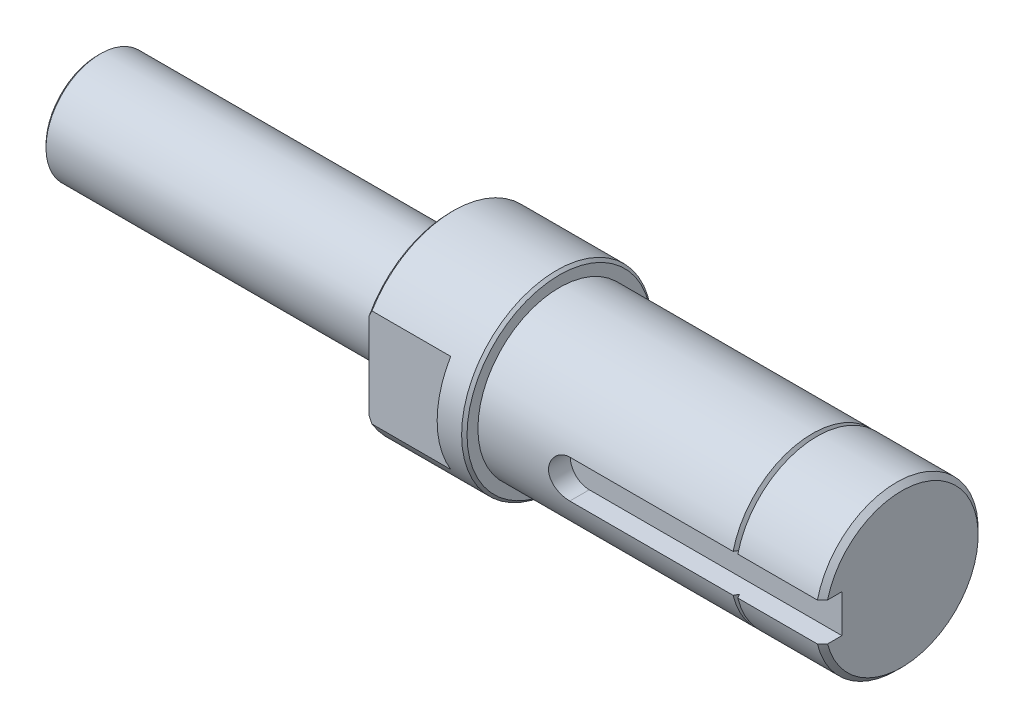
from build123d import *

# Parameters (mm, degrees)
CUT_EXTRUDE1_DEPTH = 4
CUT_EXTRUDE2_DEPTH = 15


with BuildPart() as part:
    # Sketch1 → Revolve1 (revolve)
    with BuildSketch(Plane.XY, mode=Mode.PRIVATE) as revolve1_sk:
        Polygon((-65, 0), (-65, 9.5), (-64.5, 10), (0, 10), (0, 17), (0.5, 17.5), (19.5, 17.5), (20, 17), (20, 15), (82.08, 15), (83, 14.08), (83, 0), align=None)
    revolve(revolve1_sk.sketch.rotate(Axis((83, 0, 0), (-1, 0, 0)), 270), axis=Axis((83, 0, 0), (-1, 0, 0)))

    # Sketch2 → Cut-Extrude1 (cut)
    with BuildSketch(Plane.XY.offset(15)):
        with BuildLine():
            Line((36.5, -3.5), (83, -3.5))
            Line((83, -3.5), (83, 3.5))
            Line((83, 3.5), (36.5, 3.5))
            ThreePointArc((36.5, 3.5), (33, 0), (36.5, -3.5))
        make_face()
    extrude(amount=-CUT_EXTRUDE1_DEPTH, mode=Mode.SUBTRACT)

    # Sketch3 → Cut-Extrude2 (cut)
    with BuildSketch(Plane(origin=(0, 0, 0), x_dir=(0, 0, -1), z_dir=(1, 0, 0))):
        Polygon((-30, -35), (-15, -35), (-15, 35), (15, 35), (15, -35), (30, -35), (30, 37), (-30, 37), align=None)
    extrude(amount=CUT_EXTRUDE2_DEPTH, mode=Mode.SUBTRACT)

    # Sketch5 → Cut-Revolve1 (revolve, cut)
    with BuildSketch(Plane.XY, mode=Mode.PRIVATE) as cut_revolve1_sk:
        Polygon((66.566987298, 15), (67, 14.25), (67.433012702, 15), align=None)
    revolve(cut_revolve1_sk.sketch.rotate(Axis((0, 0, 0), (1, 0, 0)), 90), axis=Axis((0, 0, 0), (1, 0, 0)), mode=Mode.SUBTRACT)


solid = part.part
